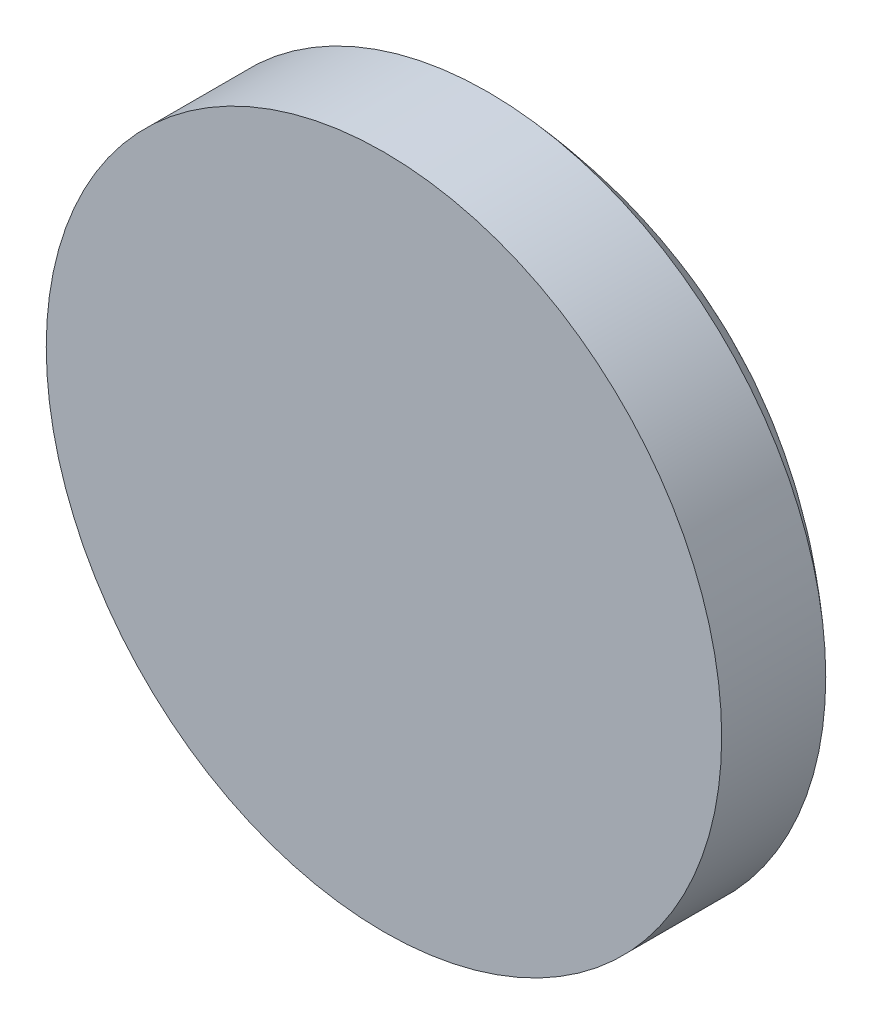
ISO-10303-21;
HEADER;
FILE_DESCRIPTION(('STEP AP214'),'2;1');
FILE_NAME('part.step','',(''),(''),'','','');
FILE_SCHEMA(('AUTOMOTIVE_DESIGN { 1 0 10303 214 1 1 1 1 }'));
ENDSEC;
DATA;
#1=APPLICATION_CONTEXT('core data for automotive mechanical design processes');
#2=APPLICATION_PROTOCOL_DEFINITION('international standard','automotive_design',2000,#1);
#3=PRODUCT_CONTEXT('',#1,'mechanical');
#4=PRODUCT('Part','Part','',(#3));
#5=PRODUCT_RELATED_PRODUCT_CATEGORY('part','',(#4));
#6=PRODUCT_DEFINITION_FORMATION('','',#4);
#7=PRODUCT_DEFINITION_CONTEXT('part definition',#1,'design');
#8=PRODUCT_DEFINITION('design','',#6,#7);
#9=PRODUCT_DEFINITION_SHAPE('','',#8);
#10=(LENGTH_UNIT() NAMED_UNIT(*) SI_UNIT(.MILLI.,.METRE.));
#11=(NAMED_UNIT(*) PLANE_ANGLE_UNIT() SI_UNIT($,.RADIAN.));
#12=(NAMED_UNIT(*) SI_UNIT($,.STERADIAN.) SOLID_ANGLE_UNIT());
#13=UNCERTAINTY_MEASURE_WITH_UNIT(LENGTH_MEASURE(1.E-05),#10,'distance_accuracy_value','');
#14=(GEOMETRIC_REPRESENTATION_CONTEXT(3) GLOBAL_UNCERTAINTY_ASSIGNED_CONTEXT((#13)) GLOBAL_UNIT_ASSIGNED_CONTEXT((#10,
#11,#12)) REPRESENTATION_CONTEXT('',''));
#15=CARTESIAN_POINT('',(0.,0.,0.));
#16=DIRECTION('',(0.,0.,1.));
#17=DIRECTION('',(1.,0.,0.));
#18=AXIS2_PLACEMENT_3D('',#15,#16,#17);
#19=CARTESIAN_POINT('',(0.,10.,5.5));
#20=DIRECTION('',(0.,0.,-1.));
#21=DIRECTION('',(-1.,0.,0.));
#22=AXIS2_PLACEMENT_3D('',#19,#20,#21);
#23=PLANE('',#22);
#24=CARTESIAN_POINT('',(0.,0.,5.5));
#25=DIRECTION('',(0.,0.,1.));
#26=DIRECTION('',(1.,0.,0.));
#27=AXIS2_PLACEMENT_3D('',#24,#25,#26);
#28=CIRCLE('',#27,7.5);
#29=CARTESIAN_POINT('',(7.5,0.,5.5));
#30=VERTEX_POINT('',#29);
#31=EDGE_CURVE('E19',#30,#30,#28,.F.);
#32=ORIENTED_EDGE('',*,*,#31,.F.);
#33=EDGE_LOOP('',(#32));
#34=FACE_BOUND('',#33,.T.);
#35=ADVANCED_FACE('F16',(#34),#23,.F.);
#36=CARTESIAN_POINT('',(0.,0.,4.34439761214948));
#37=DIRECTION('',(0.,0.,1.));
#38=DIRECTION('',(1.,0.,0.));
#39=AXIS2_PLACEMENT_3D('',#36,#37,#38);
#40=CYLINDRICAL_SURFACE('',#39,7.5);
#41=ORIENTED_EDGE('',*,*,#31,.T.);
#42=EDGE_LOOP('',(#41));
#43=FACE_BOUND('',#42,.T.);
#44=CARTESIAN_POINT('',(0.,0.,3.18879522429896));
#45=DIRECTION('',(0.,0.,1.));
#46=DIRECTION('',(0.,1.,0.));
#47=AXIS2_PLACEMENT_3D('',#44,#45,#46);
#48=CIRCLE('',#47,7.5);
#49=CARTESIAN_POINT('',(0.,7.5,3.18879522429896));
#50=VERTEX_POINT('',#49);
#51=EDGE_CURVE('E10',#50,#50,#48,.F.);
#52=ORIENTED_EDGE('',*,*,#51,.F.);
#53=EDGE_LOOP('',(#52));
#54=FACE_BOUND('',#53,.T.);
#55=ADVANCED_FACE('F29',(#43,#54),#40,.T.);
#56=CARTESIAN_POINT('',(0.,7.5,3.18879522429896));
#57=CARTESIAN_POINT('',(0.,7.421875,3.11917333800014));
#58=CARTESIAN_POINT('',(0.,7.34375,3.05080247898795));
#59=CARTESIAN_POINT('',(0.,7.1875,2.91654828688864));
#60=CARTESIAN_POINT('',(0.,7.109375,2.85066493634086));
#61=CARTESIAN_POINT('',(0.,6.953125,2.72136837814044));
#62=CARTESIAN_POINT('',(0.,6.875,2.65795515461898));
#63=CARTESIAN_POINT('',(0.,6.71875,2.53357915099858));
#64=CARTESIAN_POINT('',(0.,6.640625,2.47261635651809));
#65=CARTESIAN_POINT('',(0.,6.484375,2.35311964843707));
#66=CARTESIAN_POINT('',(0.,6.40625,2.29458572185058));
#67=CARTESIAN_POINT('',(0.,6.25,2.1799237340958));
#68=CARTESIAN_POINT('',(0.,6.171875,2.12379566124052));
#69=CARTESIAN_POINT('',(0.,6.015625,2.01392128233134));
#70=CARTESIAN_POINT('',(0.,5.9375,1.96017496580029));
#71=CARTESIAN_POINT('',(0.,5.78125,1.85503924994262));
#72=CARTESIAN_POINT('',(0.,5.703125,1.80364984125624));
#73=CARTESIAN_POINT('',(0.,5.546875,1.7032026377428));
#74=CARTESIAN_POINT('',(0.,5.46875,1.65414483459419));
#75=CARTESIAN_POINT('',(0.,5.3125,1.55833534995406));
#76=CARTESIAN_POINT('',(0.,5.234375,1.51158366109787));
#77=CARTESIAN_POINT('',(0.,5.078125,1.42036095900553));
#78=CARTESIAN_POINT('',(0.,5.,1.37588993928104));
#79=CARTESIAN_POINT('',(0.,4.84375,1.28920338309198));
#80=CARTESIAN_POINT('',(0.,4.765625,1.24698784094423));
#81=CARTESIAN_POINT('',(0.,4.609375,1.16478748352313));
#82=CARTESIAN_POINT('',(0.,4.53125,1.12480266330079));
#83=CARTESIAN_POINT('',(0.,4.375,1.04703958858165));
#84=CARTESIAN_POINT('',(0.,4.296875,1.00926132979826));
#85=CARTESIAN_POINT('',(0.,4.140625,0.935887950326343));
#86=CARTESIAN_POINT('',(0.,4.0625,0.900292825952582));
#87=CARTESIAN_POINT('',(0.,3.90625,0.831263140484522));
#88=CARTESIAN_POINT('',(0.,3.828125,0.797828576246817));
#89=CARTESIAN_POINT('',(0.,3.671875,0.73309839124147));
#90=CARTESIAN_POINT('',(0.,3.59375,0.701802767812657));
#91=CARTESIAN_POINT('',(0.,3.4375,0.641329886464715));
#92=CARTESIAN_POINT('',(0.,3.359375,0.612152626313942));
#93=CARTESIAN_POINT('',(0.,3.203125,0.555897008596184));
#94=CARTESIAN_POINT('',(0.,3.125,0.528818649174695));
#95=CARTESIAN_POINT('',(0.,2.96875,0.476742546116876));
#96=CARTESIAN_POINT('',(0.,2.890625,0.451744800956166));
#97=CARTESIAN_POINT('',(0.,2.734375,0.403812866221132));
#98=CARTESIAN_POINT('',(0.,2.65625,0.380878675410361));
#99=CARTESIAN_POINT('',(0.,2.5,0.337058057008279));
#100=CARTESIAN_POINT('',(0.,2.421875,0.316171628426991));
#101=CARTESIAN_POINT('',(0.,2.265625,0.276432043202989));
#102=CARTESIAN_POINT('',(0.,2.1875,0.257578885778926));
#103=CARTESIAN_POINT('',(0.,2.03125,0.221892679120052));
#104=CARTESIAN_POINT('',(0.,1.953125,0.205059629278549));
#105=CARTESIAN_POINT('',(0.,1.796875,0.173401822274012));
#106=CARTESIAN_POINT('',(0.,1.71875,0.158577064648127));
#107=CARTESIAN_POINT('',(0.,1.5625,0.130925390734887));
#108=CARTESIAN_POINT('',(0.,1.484375,0.118098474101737));
#109=CARTESIAN_POINT('',(0.,1.328125,0.0944334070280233));
#110=CARTESIAN_POINT('',(0.,1.25,0.0835952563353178));
#111=CARTESIAN_POINT('',(0.,1.09375,0.0639000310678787));
#112=CARTESIAN_POINT('',(0.,1.015625,0.0550429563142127));
#113=CARTESIAN_POINT('',(0.,0.859375,0.0393035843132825));
#114=CARTESIAN_POINT('',(0.,0.78125,0.0324212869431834));
#115=CARTESIAN_POINT('',(0.,0.625,0.0206265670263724));
#116=CARTESIAN_POINT('',(0.,0.546875,0.0157141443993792));
#117=CARTESIAN_POINT('',(0.,0.390625,0.00785567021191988));
#118=CARTESIAN_POINT('',(0.,0.3125,0.00490961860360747));
#119=CARTESIAN_POINT('',(0.,0.15625,0.000981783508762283));
#120=CARTESIAN_POINT('',(0.,0.078125,0.));
#121=CARTESIAN_POINT('',(0.,0.,0.));
#122=(BOUNDED_CURVE() B_SPLINE_CURVE(3,(#56,#57,#58,#59,#60,#61,#62,#63,#64,#65,#66,#67,#68,#69,
#70,#71,#72,#73,#74,#75,#76,#77,#78,#79,#80,#81,#82,#83,#84,#85,#86,#87,#88,#89,#90,#91,#92,#93,
#94,#95,#96,#97,#98,#99,#100,#101,#102,#103,#104,#105,#106,#107,#108,#109,#110,#111,#112,#113,
#114,#115,#116,#117,#118,#119,#120,#121),.UNSPECIFIED.,.F.,.F.) B_SPLINE_CURVE_WITH_KNOTS((4,2,
2,2,2,2,2,2,2,2,2,2,2,2,2,2,2,2,2,2,2,2,2,2,2,2,2,2,2,2,2,2,4),(-1.,-0.96875,-0.9375,-0.90625,
-0.875,-0.84375,-0.8125,-0.78125,-0.75,-0.71875,-0.6875,-0.65625,-0.625,-0.59375,-0.5625,
-0.53125,-0.5,-0.46875,-0.4375,-0.40625,-0.375,-0.34375,-0.3125,-0.28125,-0.25,-0.21875,-0.1875,
-0.15625,-0.125,-0.09375,-0.0625,-0.03125,0.),
.UNSPECIFIED.) CURVE() GEOMETRIC_REPRESENTATION_ITEM() RATIONAL_B_SPLINE_CURVE((1.,1.,1.,1.,1.,
1.,1.,1.,1.,1.,1.,1.,1.,1.,1.,1.,1.,1.,1.,1.,1.,1.,1.,1.,1.,1.,1.,1.,1.,1.,1.,1.,1.,1.,1.,1.,1.,
1.,1.,1.,1.,1.,1.,1.,1.,1.,1.,1.,1.,1.,1.,1.,1.,1.,1.,1.,1.,1.,1.,1.,1.,1.,1.,1.,1.,1.)) REPRESENTATION_ITEM(''));
#123=CARTESIAN_POINT('',(0.,0.,3.18879522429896));
#124=DIRECTION('',(0.,0.,1.));
#125=AXIS1_PLACEMENT('',#123,#124);
#126=SURFACE_OF_REVOLUTION('',#122,#125);
#127=CARTESIAN_POINT('',(0.,0.,0.));
#128=VERTEX_POINT('',#127);
#129=VERTEX_LOOP('',#128);
#130=FACE_BOUND('',#129,.T.);
#131=ORIENTED_EDGE('',*,*,#51,.T.);
#132=EDGE_LOOP('',(#131));
#133=FACE_BOUND('',#132,.T.);
#134=ADVANCED_FACE('F26',(#130,#133),#126,.F.);
#135=CLOSED_SHELL('',(#35,#55,#134));
#136=MANIFOLD_SOLID_BREP('B1',#135);
#137=ADVANCED_BREP_SHAPE_REPRESENTATION('',(#18,#136),#14);
#138=SHAPE_DEFINITION_REPRESENTATION(#9,#137);
ENDSEC;
END-ISO-10303-21;
